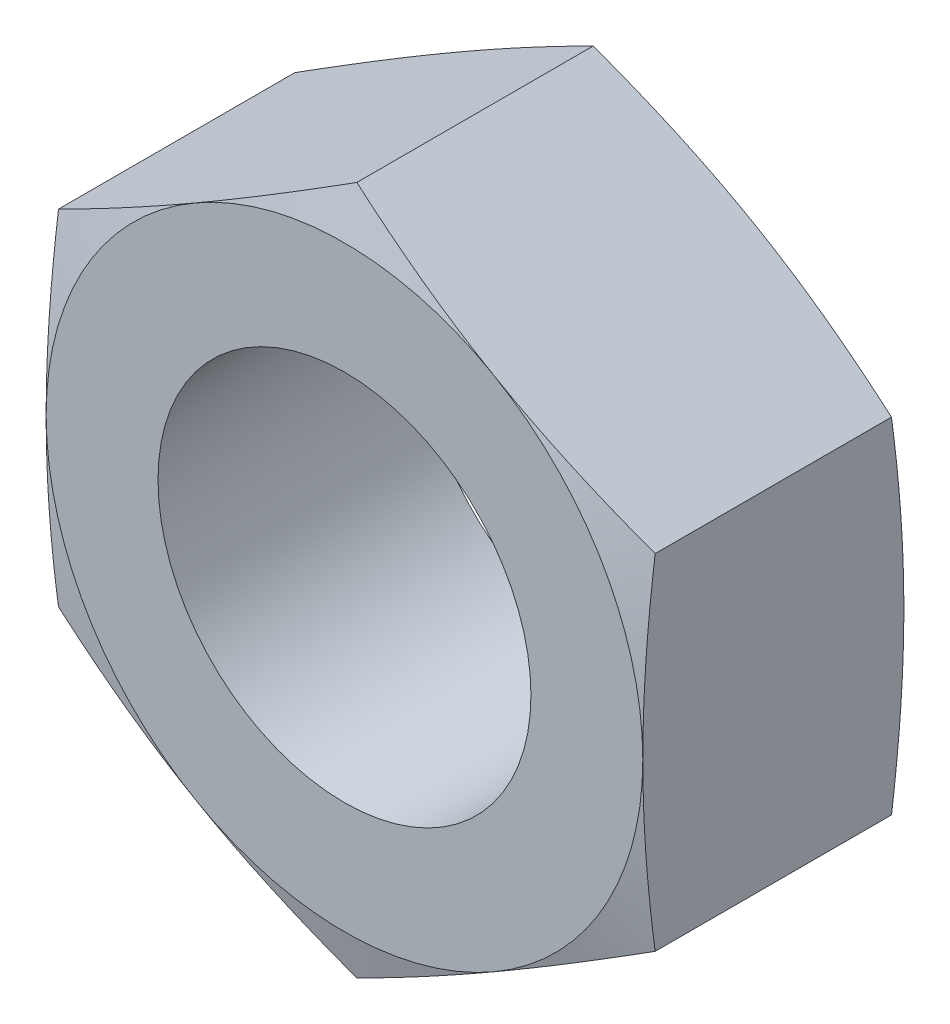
ISO-10303-21;
HEADER;
FILE_DESCRIPTION(('STEP AP214'),'2;1');
FILE_NAME('part.step','',(''),(''),'','','');
FILE_SCHEMA(('AUTOMOTIVE_DESIGN { 1 0 10303 214 1 1 1 1 }'));
ENDSEC;
DATA;
#1=APPLICATION_CONTEXT('core data for automotive mechanical design processes');
#2=APPLICATION_PROTOCOL_DEFINITION('international standard','automotive_design',2000,#1);
#3=PRODUCT_CONTEXT('',#1,'mechanical');
#4=PRODUCT('Part','Part','',(#3));
#5=PRODUCT_RELATED_PRODUCT_CATEGORY('part','',(#4));
#6=PRODUCT_DEFINITION_FORMATION('','',#4);
#7=PRODUCT_DEFINITION_CONTEXT('part definition',#1,'design');
#8=PRODUCT_DEFINITION('design','',#6,#7);
#9=PRODUCT_DEFINITION_SHAPE('','',#8);
#10=(LENGTH_UNIT() NAMED_UNIT(*) SI_UNIT(.MILLI.,.METRE.));
#11=(NAMED_UNIT(*) PLANE_ANGLE_UNIT() SI_UNIT($,.RADIAN.));
#12=(NAMED_UNIT(*) SI_UNIT($,.STERADIAN.) SOLID_ANGLE_UNIT());
#13=UNCERTAINTY_MEASURE_WITH_UNIT(LENGTH_MEASURE(1.E-05),#10,'distance_accuracy_value','');
#14=(GEOMETRIC_REPRESENTATION_CONTEXT(3) GLOBAL_UNCERTAINTY_ASSIGNED_CONTEXT((#13)) GLOBAL_UNIT_ASSIGNED_CONTEXT((#10,
#11,#12)) REPRESENTATION_CONTEXT('',''));
#15=CARTESIAN_POINT('',(0.,0.,0.));
#16=DIRECTION('',(0.,0.,1.));
#17=DIRECTION('',(1.,0.,0.));
#18=AXIS2_PLACEMENT_3D('',#15,#16,#17);
#19=CARTESIAN_POINT('',(0.,0.,7.));
#20=DIRECTION('',(0.,0.,1.));
#21=DIRECTION('',(1.,0.,0.));
#22=AXIS2_PLACEMENT_3D('',#19,#20,#21);
#23=PLANE('',#22);
#24=CARTESIAN_POINT('',(0.,0.,7.));
#25=DIRECTION('',(0.,0.,1.));
#26=DIRECTION('',(1.,0.,0.));
#27=AXIS2_PLACEMENT_3D('',#24,#25,#26);
#28=CIRCLE('',#27,5.);
#29=CARTESIAN_POINT('',(5.,0.,7.));
#30=VERTEX_POINT('',#29);
#31=EDGE_CURVE('E238',#30,#30,#28,.T.);
#32=ORIENTED_EDGE('',*,*,#31,.F.);
#33=EDGE_LOOP('',(#32));
#34=FACE_BOUND('',#33,.T.);
#35=CARTESIAN_POINT('',(0.,0.,7.));
#36=DIRECTION('',(0.,0.,1.));
#37=DIRECTION('',(1.,0.,0.));
#38=AXIS2_PLACEMENT_3D('',#35,#36,#37);
#39=CIRCLE('',#38,8.);
#40=CARTESIAN_POINT('',(4.,-6.92820323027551,7.));
#41=VERTEX_POINT('',#40);
#42=CARTESIAN_POINT('',(8.,0.,7.));
#43=VERTEX_POINT('',#42);
#44=EDGE_CURVE('E150',#41,#43,#39,.T.);
#45=ORIENTED_EDGE('',*,*,#44,.T.);
#46=CARTESIAN_POINT('',(4.,6.92820323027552,7.));
#47=VERTEX_POINT('',#46);
#48=EDGE_CURVE('E152',#43,#47,#39,.T.);
#49=ORIENTED_EDGE('',*,*,#48,.T.);
#50=CARTESIAN_POINT('',(-4.,6.92820323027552,7.));
#51=VERTEX_POINT('',#50);
#52=EDGE_CURVE('E363',#47,#51,#39,.T.);
#53=ORIENTED_EDGE('',*,*,#52,.T.);
#54=CARTESIAN_POINT('',(-8.,0.,7.));
#55=VERTEX_POINT('',#54);
#56=EDGE_CURVE('E36',#51,#55,#39,.T.);
#57=ORIENTED_EDGE('',*,*,#56,.T.);
#58=CARTESIAN_POINT('',(-4.,-6.92820323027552,7.));
#59=VERTEX_POINT('',#58);
#60=EDGE_CURVE('E44',#55,#59,#39,.T.);
#61=ORIENTED_EDGE('',*,*,#60,.T.);
#62=EDGE_CURVE('E365',#59,#41,#39,.T.);
#63=ORIENTED_EDGE('',*,*,#62,.T.);
#64=EDGE_LOOP('',(#45,#49,#53,#57,#61,#63));
#65=FACE_BOUND('',#64,.T.);
#66=ADVANCED_FACE('F14',(#34,#65),#23,.T.);
#67=CARTESIAN_POINT('',(0.,0.,0.));
#68=DIRECTION('',(0.,0.,1.));
#69=DIRECTION('',(1.,0.,0.));
#70=AXIS2_PLACEMENT_3D('',#67,#68,#69);
#71=PLANE('',#70);
#72=CARTESIAN_POINT('',(0.,0.,0.));
#73=DIRECTION('',(0.,0.,1.));
#74=DIRECTION('',(1.,0.,0.));
#75=AXIS2_PLACEMENT_3D('',#72,#73,#74);
#76=CIRCLE('',#75,5.);
#77=CARTESIAN_POINT('',(5.,0.,0.));
#78=VERTEX_POINT('',#77);
#79=EDGE_CURVE('E242',#78,#78,#76,.T.);
#80=ORIENTED_EDGE('',*,*,#79,.T.);
#81=EDGE_LOOP('',(#80));
#82=FACE_BOUND('',#81,.T.);
#83=CARTESIAN_POINT('',(0.,0.,0.));
#84=DIRECTION('',(0.,0.,1.));
#85=DIRECTION('',(1.,0.,0.));
#86=AXIS2_PLACEMENT_3D('',#83,#84,#85);
#87=CIRCLE('',#86,8.);
#88=CARTESIAN_POINT('',(8.,0.,0.));
#89=VERTEX_POINT('',#88);
#90=CARTESIAN_POINT('',(4.,6.92820323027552,0.));
#91=VERTEX_POINT('',#90);
#92=EDGE_CURVE('E122',#89,#91,#87,.T.);
#93=ORIENTED_EDGE('',*,*,#92,.F.);
#94=CARTESIAN_POINT('',(4.,-6.92820323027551,0.));
#95=VERTEX_POINT('',#94);
#96=EDGE_CURVE('E151',#95,#89,#87,.T.);
#97=ORIENTED_EDGE('',*,*,#96,.F.);
#98=CARTESIAN_POINT('',(-4.,-6.92820323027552,0.));
#99=VERTEX_POINT('',#98);
#100=EDGE_CURVE('E147',#99,#95,#87,.T.);
#101=ORIENTED_EDGE('',*,*,#100,.F.);
#102=CARTESIAN_POINT('',(-8.,0.,0.));
#103=VERTEX_POINT('',#102);
#104=EDGE_CURVE('E146',#103,#99,#87,.T.);
#105=ORIENTED_EDGE('',*,*,#104,.F.);
#106=CARTESIAN_POINT('',(-4.,6.92820323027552,0.));
#107=VERTEX_POINT('',#106);
#108=EDGE_CURVE('E123',#107,#103,#87,.T.);
#109=ORIENTED_EDGE('',*,*,#108,.F.);
#110=EDGE_CURVE('E111',#91,#107,#87,.T.);
#111=ORIENTED_EDGE('',*,*,#110,.F.);
#112=EDGE_LOOP('',(#93,#97,#101,#105,#109,#111));
#113=FACE_BOUND('',#112,.T.);
#114=ADVANCED_FACE('F144',(#82,#113),#71,.F.);
#115=CARTESIAN_POINT('',(0.,0.,7.));
#116=DIRECTION('',(0.,0.,-1.));
#117=DIRECTION('',(-1.,0.,0.));
#118=AXIS2_PLACEMENT_3D('',#115,#116,#117);
#119=CYLINDRICAL_SURFACE('',#118,5.);
#120=ORIENTED_EDGE('',*,*,#31,.T.);
#121=EDGE_LOOP('',(#120));
#122=FACE_BOUND('',#121,.T.);
#123=ORIENTED_EDGE('',*,*,#79,.F.);
#124=EDGE_LOOP('',(#123));
#125=FACE_BOUND('',#124,.T.);
#126=ADVANCED_FACE('F182',(#122,#125),#119,.F.);
#127=CARTESIAN_POINT('',(0.,0.,0.892106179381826));
#128=DIRECTION('',(0.,0.,1.));
#129=DIRECTION('',(1.,0.,0.));
#130=AXIS2_PLACEMENT_3D('',#127,#128,#129);
#131=CONICAL_SURFACE('',#130,11.3293855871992,1.30899693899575);
#132=CARTESIAN_POINT('',(8.0002,-4.61868668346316,0.33164601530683));
#133=CARTESIAN_POINT('',(7.66796351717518,-4.81050350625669,0.280227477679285));
#134=CARTESIAN_POINT('',(7.33512465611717,-5.0026681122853,0.233547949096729));
#135=CARTESIAN_POINT('',(6.66827150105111,-5.38767596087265,0.151536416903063));
#136=CARTESIAN_POINT('',(6.33425678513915,-5.58051944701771,0.116209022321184));
#137=CARTESIAN_POINT('',(5.66707702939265,-5.96571585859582,0.0589641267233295));
#138=CARTESIAN_POINT('',(5.33391650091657,-6.15806617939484,0.0369783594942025));
#139=CARTESIAN_POINT('',(4.66717058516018,-6.54301211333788,0.00749769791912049));
#140=CARTESIAN_POINT('',(4.33358529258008,-6.7356076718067,0.));
#141=CARTESIAN_POINT('',(3.6664147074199,-7.12079878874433,0.));
#142=CARTESIAN_POINT('',(3.33282941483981,-7.31339434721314,0.00749769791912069));
#143=CARTESIAN_POINT('',(2.66608349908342,-7.69834028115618,0.0369783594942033));
#144=CARTESIAN_POINT('',(2.33292297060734,-7.8906906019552,0.0589641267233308));
#145=CARTESIAN_POINT('',(1.66574321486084,-8.27588701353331,0.116209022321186));
#146=CARTESIAN_POINT('',(1.33172849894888,-8.46873049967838,0.151536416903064));
#147=CARTESIAN_POINT('',(0.664875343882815,-8.85373834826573,0.23354794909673));
#148=CARTESIAN_POINT('',(0.332036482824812,-9.04590295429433,0.280227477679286));
#149=CARTESIAN_POINT('',(-0.000200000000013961,-9.23771977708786,0.331646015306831));
#150=B_SPLINE_CURVE_WITH_KNOTS('',3,(#132,#133,#134,#135,#136,#137,#138,#139,#140,#141,#142,
#143,#144,#145,#146,#147,#148,#149),.UNSPECIFIED.,.F.,.F.,(4,2,2,2,2,2,2,2,4),(0.,
1.1612532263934,2.322977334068,3.47870589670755,4.63421079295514,5.78971568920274,
6.94544425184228,8.10716835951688,9.26842158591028),.UNSPECIFIED.);
#151=CARTESIAN_POINT('',(8.,-4.618802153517,0.331615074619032));
#152=VERTEX_POINT('',#151);
#153=EDGE_CURVE('E153',#152,#95,#150,.T.);
#154=ORIENTED_EDGE('',*,*,#153,.T.);
#155=ORIENTED_EDGE('',*,*,#96,.T.);
#156=CARTESIAN_POINT('',(8.,-12.2518561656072,1.77715400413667));
#157=CARTESIAN_POINT('',(8.,-11.8885352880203,1.69566254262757));
#158=CARTESIAN_POINT('',(8.,-11.5249880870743,1.61516215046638));
#159=CARTESIAN_POINT('',(8.,-10.7973298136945,1.45667851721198));
#160=CARTESIAN_POINT('',(8.,-10.4332187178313,1.37869538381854));
#161=CARTESIAN_POINT('',(8.,-9.70400001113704,1.2257143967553));
#162=CARTESIAN_POINT('',(8.,-9.33889177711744,1.15071950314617));
#163=CARTESIAN_POINT('',(8.,-8.60791779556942,1.0045191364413));
#164=CARTESIAN_POINT('',(8.,-8.24205205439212,0.933313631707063));
#165=CARTESIAN_POINT('',(8.,-7.51234580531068,0.796143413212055));
#166=CARTESIAN_POINT('',(8.,-7.14851231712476,0.730141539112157));
#167=CARTESIAN_POINT('',(8.,-6.41985477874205,0.603863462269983));
#168=CARTESIAN_POINT('',(8.,-6.05503075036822,0.543587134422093));
#169=CARTESIAN_POINT('',(8.,-5.32431726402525,0.430110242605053));
#170=CARTESIAN_POINT('',(8.,-4.95842793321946,0.376908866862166));
#171=CARTESIAN_POINT('',(8.,-4.22548386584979,0.279143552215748));
#172=CARTESIAN_POINT('',(8.,-3.85842912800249,0.234579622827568));
#173=CARTESIAN_POINT('',(8.,-3.11899889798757,0.155343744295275));
#174=CARTESIAN_POINT('',(8.,-2.74661049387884,0.120790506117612));
#175=CARTESIAN_POINT('',(8.,-2.0008902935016,0.0639552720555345));
#176=CARTESIAN_POINT('',(8.,-1.62755851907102,0.0416729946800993));
#177=CARTESIAN_POINT('',(8.,-0.88049419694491,0.0106788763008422));
#178=CARTESIAN_POINT('',(8.,-0.506761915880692,0.00196073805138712));
#179=CARTESIAN_POINT('',(8.,0.240766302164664,-0.00136832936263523));
#180=CARTESIAN_POINT('',(8.,0.61456223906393,0.00402072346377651));
#181=CARTESIAN_POINT('',(8.,1.36305708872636,0.0286033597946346));
#182=CARTESIAN_POINT('',(8.,1.73775431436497,0.0478472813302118));
#183=CARTESIAN_POINT('',(8.,2.48627200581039,0.0990382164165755));
#184=CARTESIAN_POINT('',(8.,2.86009245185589,0.130985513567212));
#185=CARTESIAN_POINT('',(8.,3.60685276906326,0.205961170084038));
#186=CARTESIAN_POINT('',(7.99999999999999,3.97979189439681,0.248996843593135));
#187=CARTESIAN_POINT('',(8.,4.7244685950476,0.344348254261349));
#188=CARTESIAN_POINT('',(8.,5.09620616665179,0.39666402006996));
#189=CARTESIAN_POINT('',(8.,5.81697867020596,0.505635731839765));
#190=CARTESIAN_POINT('',(8.,6.16607899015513,0.56186352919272));
#191=CARTESIAN_POINT('',(7.99999999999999,6.86335023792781,0.679839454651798));
#192=CARTESIAN_POINT('',(7.99999999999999,7.21152113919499,0.741587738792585));
#193=CARTESIAN_POINT('',(7.99999999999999,7.90706352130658,0.869587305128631));
#194=CARTESIAN_POINT('',(7.99999999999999,8.25443492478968,0.935839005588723));
#195=CARTESIAN_POINT('',(7.99999999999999,8.94846021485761,1.07201009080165));
#196=CARTESIAN_POINT('',(7.99999999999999,9.29511409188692,1.14192952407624));
#197=CARTESIAN_POINT('',(7.99999999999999,9.98788444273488,1.28478356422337));
#198=CARTESIAN_POINT('',(7.99999999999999,10.3340007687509,1.35771888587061));
#199=CARTESIAN_POINT('',(7.99999999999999,11.0257043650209,1.50606013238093));
#200=CARTESIAN_POINT('',(7.99999999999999,11.3712916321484,1.58146607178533));
#201=CARTESIAN_POINT('',(7.99999999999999,12.4073312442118,1.81071761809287));
#202=CARTESIAN_POINT('',(7.99999999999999,13.0971097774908,1.96760706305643));
#203=CARTESIAN_POINT('',(7.99999999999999,14.4685283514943,2.28545064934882));
#204=CARTESIAN_POINT('',(7.99999999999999,15.1501813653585,2.4463491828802));
#205=CARTESIAN_POINT('',(7.99999999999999,16.5125397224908,2.77215878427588));
#206=CARTESIAN_POINT('',(7.99999999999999,17.1932450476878,2.93706992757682));
#207=CARTESIAN_POINT('',(7.99999999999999,18.5530714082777,3.26963758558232));
#208=CARTESIAN_POINT('',(7.99999999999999,19.2321933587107,3.43729036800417));
#209=CARTESIAN_POINT('',(7.99999999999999,20.5898486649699,3.77486747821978));
#210=CARTESIAN_POINT('',(7.99999999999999,21.2683820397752,3.94479172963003));
#211=CARTESIAN_POINT('',(8.,21.946710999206,4.11551906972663));
#212=B_SPLINE_CURVE_WITH_KNOTS('',3,(#156,#157,#158,#159,#160,#161,#162,#163,#164,#165,#166,
#167,#168,#169,#170,#171,#172,#173,#174,#175,#176,#177,#178,#179,#180,#181,#182,#183,#184,#185,
#186,#187,#188,#189,#190,#191,#192,#193,#194,#195,#196,#197,#198,#199,#200,#201,#202,#203,#204,
#205,#206,#207,#208,#209,#210,#211),.UNSPECIFIED.,.F.,.F.,(4,2,2,2,2,2,2,2,2,2,2,2,2,2,2,2,2,2,
2,2,2,2,2,2,2,2,2,4),(0.,1.11704804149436,2.23414381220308,3.35231994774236,4.47048674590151,
5.5797650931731,6.68901919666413,7.79814591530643,8.90727385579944,10.0290611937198,
11.1508227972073,12.2720634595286,13.3933026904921,14.5186363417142,15.6439951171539,
16.7700981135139,17.8962045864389,18.9569505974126,20.0177265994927,21.078601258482,
22.1394899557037,23.2006315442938,24.261779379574,26.3839267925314,28.4850677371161,
30.5862482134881,32.6847736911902,34.7832287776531),.UNSPECIFIED.);
#213=EDGE_CURVE('E186',#89,#152,#212,.F.);
#214=ORIENTED_EDGE('',*,*,#213,.T.);
#215=EDGE_LOOP('',(#154,#155,#214));
#216=FACE_BOUND('',#215,.T.);
#217=ADVANCED_FACE('F179',(#216),#131,.T.);
#218=CARTESIAN_POINT('',(-0.00019999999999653,9.23771977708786,0.331646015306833));
#219=CARTESIAN_POINT('',(0.332036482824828,9.04590295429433,0.280227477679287));
#220=CARTESIAN_POINT('',(0.664875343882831,8.85373834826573,0.233547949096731));
#221=CARTESIAN_POINT('',(1.33172849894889,8.46873049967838,0.151536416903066));
#222=CARTESIAN_POINT('',(1.66574321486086,8.27588701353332,0.116209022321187));
#223=CARTESIAN_POINT('',(2.33292297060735,7.89069060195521,0.0589641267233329));
#224=CARTESIAN_POINT('',(2.66608349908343,7.69834028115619,0.0369783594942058));
#225=CARTESIAN_POINT('',(3.33282941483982,7.31339434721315,0.00749769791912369));
#226=CARTESIAN_POINT('',(3.66641470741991,7.12079878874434,0.));
#227=CARTESIAN_POINT('',(4.33358529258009,6.73560767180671,0.));
#228=CARTESIAN_POINT('',(4.66717058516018,6.54301211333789,0.00749769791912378));
#229=CARTESIAN_POINT('',(5.33391650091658,6.15806617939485,0.0369783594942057));
#230=CARTESIAN_POINT('',(5.66707702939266,5.96571585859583,0.0589641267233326));
#231=CARTESIAN_POINT('',(6.33425678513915,5.58051944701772,0.116209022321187));
#232=CARTESIAN_POINT('',(6.66827150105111,5.38767596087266,0.151536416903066));
#233=CARTESIAN_POINT('',(7.33512465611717,5.00266811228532,0.233547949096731));
#234=CARTESIAN_POINT('',(7.66796351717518,4.81050350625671,0.280227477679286));
#235=CARTESIAN_POINT('',(8.0002,4.61868668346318,0.331646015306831));
#236=B_SPLINE_CURVE_WITH_KNOTS('',3,(#218,#219,#220,#221,#222,#223,#224,#225,#226,#227,#228,
#229,#230,#231,#232,#233,#234,#235),.UNSPECIFIED.,.F.,.F.,(4,2,2,2,2,2,2,2,4),(0.,
1.1612532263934,2.32297733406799,3.47870589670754,4.63421079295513,5.78971568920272,
6.94544425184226,8.10716835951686,9.26842158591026),.UNSPECIFIED.);
#237=CARTESIAN_POINT('',(8.,4.61880215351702,0.331615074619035));
#238=VERTEX_POINT('',#237);
#239=EDGE_CURVE('E162',#91,#238,#236,.T.);
#240=ORIENTED_EDGE('',*,*,#239,.T.);
#241=EDGE_CURVE('E257',#238,#89,#212,.F.);
#242=ORIENTED_EDGE('',*,*,#241,.T.);
#243=ORIENTED_EDGE('',*,*,#92,.T.);
#244=EDGE_LOOP('',(#240,#242,#243));
#245=FACE_BOUND('',#244,.T.);
#246=ADVANCED_FACE('F277',(#245),#131,.T.);
#247=CARTESIAN_POINT('',(0.,0.,7.));
#248=DIRECTION('',(0.,0.,-1.));
#249=DIRECTION('',(-1.,0.,0.));
#250=AXIS2_PLACEMENT_3D('',#247,#248,#249);
#251=CONICAL_SURFACE('',#250,8.,1.30899693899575);
#252=CARTESIAN_POINT('',(8.0002,4.61868668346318,6.66835398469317));
#253=CARTESIAN_POINT('',(7.66796351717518,4.81050350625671,6.71977252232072));
#254=CARTESIAN_POINT('',(7.33512465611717,5.00266811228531,6.76645205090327));
#255=CARTESIAN_POINT('',(6.66827150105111,5.38767596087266,6.84846358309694));
#256=CARTESIAN_POINT('',(6.33425678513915,5.58051944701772,6.88379097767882));
#257=CARTESIAN_POINT('',(5.66707702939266,5.96571585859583,6.94103587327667));
#258=CARTESIAN_POINT('',(5.33391650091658,6.15806617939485,6.9630216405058));
#259=CARTESIAN_POINT('',(4.66717058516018,6.54301211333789,6.99250230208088));
#260=CARTESIAN_POINT('',(4.33358529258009,6.73560767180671,7.));
#261=CARTESIAN_POINT('',(3.66641470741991,7.12079878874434,7.));
#262=CARTESIAN_POINT('',(3.33282941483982,7.31339434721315,6.99250230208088));
#263=CARTESIAN_POINT('',(2.66608349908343,7.69834028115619,6.9630216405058));
#264=CARTESIAN_POINT('',(2.33292297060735,7.89069060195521,6.94103587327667));
#265=CARTESIAN_POINT('',(1.66574321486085,8.27588701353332,6.88379097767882));
#266=CARTESIAN_POINT('',(1.33172849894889,8.46873049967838,6.84846358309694));
#267=CARTESIAN_POINT('',(0.664875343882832,8.85373834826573,6.76645205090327));
#268=CARTESIAN_POINT('',(0.332036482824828,9.04590295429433,6.71977252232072));
#269=CARTESIAN_POINT('',(-0.000199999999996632,9.23771977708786,6.66835398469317));
#270=B_SPLINE_CURVE_WITH_KNOTS('',3,(#252,#253,#254,#255,#256,#257,#258,#259,#260,#261,#262,
#263,#264,#265,#266,#267,#268,#269),.UNSPECIFIED.,.F.,.F.,(4,2,2,2,2,2,2,2,4),(0.,
1.1612532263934,2.32297733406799,3.47870589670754,4.63421079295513,5.78971568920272,
6.94544425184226,8.10716835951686,9.26842158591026),.UNSPECIFIED.);
#271=CARTESIAN_POINT('',(8.,4.61880215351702,6.66838492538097));
#272=VERTEX_POINT('',#271);
#273=EDGE_CURVE('E237',#272,#47,#270,.T.);
#274=ORIENTED_EDGE('',*,*,#273,.T.);
#275=ORIENTED_EDGE('',*,*,#48,.F.);
#276=CARTESIAN_POINT('',(8.,-12.2518561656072,5.22284599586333));
#277=CARTESIAN_POINT('',(8.,-11.8885352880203,5.30433745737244));
#278=CARTESIAN_POINT('',(8.,-11.5249880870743,5.38483784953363));
#279=CARTESIAN_POINT('',(8.,-10.7973298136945,5.54332148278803));
#280=CARTESIAN_POINT('',(8.,-10.4332187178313,5.62130461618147));
#281=CARTESIAN_POINT('',(8.,-9.70400001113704,5.7742856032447));
#282=CARTESIAN_POINT('',(8.,-9.33889177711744,5.84928049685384));
#283=CARTESIAN_POINT('',(8.,-8.60791779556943,5.99548086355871));
#284=CARTESIAN_POINT('',(8.,-8.24205205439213,6.06668636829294));
#285=CARTESIAN_POINT('',(8.,-7.51234580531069,6.20385658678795));
#286=CARTESIAN_POINT('',(8.,-7.14851231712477,6.26985846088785));
#287=CARTESIAN_POINT('',(8.,-6.41985477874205,6.39613653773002));
#288=CARTESIAN_POINT('',(8.,-6.05503075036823,6.45641286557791));
#289=CARTESIAN_POINT('',(8.,-5.32431726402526,6.56988975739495));
#290=CARTESIAN_POINT('',(8.,-4.95842793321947,6.62309113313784));
#291=CARTESIAN_POINT('',(8.,-4.22548386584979,6.72085644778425));
#292=CARTESIAN_POINT('',(8.,-3.8584291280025,6.76542037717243));
#293=CARTESIAN_POINT('',(8.,-3.11899889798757,6.84465625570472));
#294=CARTESIAN_POINT('',(8.,-2.74661049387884,6.87920949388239));
#295=CARTESIAN_POINT('',(8.,-2.0008902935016,6.93604472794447));
#296=CARTESIAN_POINT('',(8.,-1.62755851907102,6.9583270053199));
#297=CARTESIAN_POINT('',(8.,-0.880494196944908,6.98932112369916));
#298=CARTESIAN_POINT('',(8.,-0.50676191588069,6.99803926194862));
#299=CARTESIAN_POINT('',(8.,0.240766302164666,7.00136832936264));
#300=CARTESIAN_POINT('',(8.,0.614562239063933,6.99597927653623));
#301=CARTESIAN_POINT('',(8.,1.36305708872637,6.97139664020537));
#302=CARTESIAN_POINT('',(8.,1.73775431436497,6.95215271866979));
#303=CARTESIAN_POINT('',(8.,2.48627200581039,6.90096178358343));
#304=CARTESIAN_POINT('',(8.,2.86009245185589,6.86901448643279));
#305=CARTESIAN_POINT('',(8.,3.60685276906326,6.79403882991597));
#306=CARTESIAN_POINT('',(7.99999999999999,3.97979189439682,6.75100315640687));
#307=CARTESIAN_POINT('',(8.,4.7244685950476,6.65565174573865));
#308=CARTESIAN_POINT('',(8.,5.09620616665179,6.60333597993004));
#309=CARTESIAN_POINT('',(8.,5.81697867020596,6.49436426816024));
#310=CARTESIAN_POINT('',(8.,6.16607899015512,6.43813647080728));
#311=CARTESIAN_POINT('',(7.99999999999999,6.8633502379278,6.32016054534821));
#312=CARTESIAN_POINT('',(7.99999999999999,7.21152113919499,6.25841226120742));
#313=CARTESIAN_POINT('',(7.99999999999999,7.90706352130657,6.13041269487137));
#314=CARTESIAN_POINT('',(7.99999999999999,8.25443492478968,6.06416099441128));
#315=CARTESIAN_POINT('',(7.99999999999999,8.9484602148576,5.92798990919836));
#316=CARTESIAN_POINT('',(7.99999999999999,9.29511409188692,5.85807047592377));
#317=CARTESIAN_POINT('',(7.99999999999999,9.98788444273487,5.71521643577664));
#318=CARTESIAN_POINT('',(7.99999999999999,10.3340007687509,5.6422811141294));
#319=CARTESIAN_POINT('',(7.99999999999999,11.0257043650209,5.49393986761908));
#320=CARTESIAN_POINT('',(7.99999999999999,11.3712916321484,5.41853392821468));
#321=CARTESIAN_POINT('',(7.99999999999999,12.4073312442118,5.18928238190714));
#322=CARTESIAN_POINT('',(7.99999999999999,13.0971097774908,5.03239293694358));
#323=CARTESIAN_POINT('',(7.99999999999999,14.4685283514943,4.71454935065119));
#324=CARTESIAN_POINT('',(7.99999999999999,15.1501813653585,4.55365081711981));
#325=CARTESIAN_POINT('',(7.99999999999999,16.5125397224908,4.22784121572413));
#326=CARTESIAN_POINT('',(7.99999999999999,17.1932450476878,4.06293007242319));
#327=CARTESIAN_POINT('',(7.99999999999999,18.5530714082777,3.73036241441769));
#328=CARTESIAN_POINT('',(7.99999999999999,19.2321933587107,3.56270963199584));
#329=CARTESIAN_POINT('',(7.99999999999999,20.5898486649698,3.22513252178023));
#330=CARTESIAN_POINT('',(7.99999999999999,21.2683820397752,3.05520827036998));
#331=CARTESIAN_POINT('',(8.,21.946710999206,2.88448093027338));
#332=B_SPLINE_CURVE_WITH_KNOTS('',3,(#276,#277,#278,#279,#280,#281,#282,#283,#284,#285,#286,
#287,#288,#289,#290,#291,#292,#293,#294,#295,#296,#297,#298,#299,#300,#301,#302,#303,#304,#305,
#306,#307,#308,#309,#310,#311,#312,#313,#314,#315,#316,#317,#318,#319,#320,#321,#322,#323,#324,
#325,#326,#327,#328,#329,#330,#331),.UNSPECIFIED.,.F.,.F.,(4,2,2,2,2,2,2,2,2,2,2,2,2,2,2,2,2,2,
2,2,2,2,2,2,2,2,2,4),(0.,1.11704804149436,2.23414381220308,3.35231994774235,4.47048674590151,
5.57976509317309,6.68901919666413,7.79814591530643,8.90727385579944,10.0290611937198,
11.1508227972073,12.2720634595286,13.3933026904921,14.5186363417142,15.6439951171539,
16.7700981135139,17.8962045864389,18.9569505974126,20.0177265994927,21.078601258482,
22.1394899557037,23.2006315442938,24.261779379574,26.3839267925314,28.4850677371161,
30.5862482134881,32.6847736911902,34.7832287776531),.UNSPECIFIED.);
#333=EDGE_CURVE('E19',#43,#272,#332,.T.);
#334=ORIENTED_EDGE('',*,*,#333,.T.);
#335=EDGE_LOOP('',(#274,#275,#334));
#336=FACE_BOUND('',#335,.T.);
#337=ADVANCED_FACE('F180',(#336),#251,.T.);
#338=CARTESIAN_POINT('',(-0.000200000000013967,-9.23771977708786,6.66835398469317));
#339=CARTESIAN_POINT('',(0.332036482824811,-9.04590295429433,6.71977252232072));
#340=CARTESIAN_POINT('',(0.664875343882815,-8.85373834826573,6.76645205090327));
#341=CARTESIAN_POINT('',(1.33172849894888,-8.46873049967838,6.84846358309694));
#342=CARTESIAN_POINT('',(1.66574321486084,-8.27588701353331,6.88379097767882));
#343=CARTESIAN_POINT('',(2.33292297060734,-7.8906906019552,6.94103587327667));
#344=CARTESIAN_POINT('',(2.66608349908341,-7.69834028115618,6.9630216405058));
#345=CARTESIAN_POINT('',(3.33282941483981,-7.31339434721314,6.99250230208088));
#346=CARTESIAN_POINT('',(3.6664147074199,-7.12079878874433,7.));
#347=CARTESIAN_POINT('',(4.33358529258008,-6.7356076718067,7.));
#348=CARTESIAN_POINT('',(4.66717058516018,-6.54301211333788,6.99250230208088));
#349=CARTESIAN_POINT('',(5.33391650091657,-6.15806617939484,6.9630216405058));
#350=CARTESIAN_POINT('',(5.66707702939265,-5.96571585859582,6.94103587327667));
#351=CARTESIAN_POINT('',(6.33425678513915,-5.58051944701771,6.88379097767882));
#352=CARTESIAN_POINT('',(6.66827150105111,-5.38767596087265,6.84846358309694));
#353=CARTESIAN_POINT('',(7.33512465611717,-5.0026681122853,6.76645205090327));
#354=CARTESIAN_POINT('',(7.66796351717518,-4.81050350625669,6.71977252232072));
#355=CARTESIAN_POINT('',(8.0002,-4.61868668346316,6.66835398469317));
#356=B_SPLINE_CURVE_WITH_KNOTS('',3,(#338,#339,#340,#341,#342,#343,#344,#345,#346,#347,#348,
#349,#350,#351,#352,#353,#354,#355),.UNSPECIFIED.,.F.,.F.,(4,2,2,2,2,2,2,2,4),(0.,
1.16125322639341,2.322977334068,3.47870589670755,4.63421079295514,5.78971568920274,
6.94544425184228,8.10716835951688,9.26842158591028),.UNSPECIFIED.);
#357=CARTESIAN_POINT('',(8.,-4.618802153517,6.66838492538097));
#358=VERTEX_POINT('',#357);
#359=EDGE_CURVE('E285',#41,#358,#356,.T.);
#360=ORIENTED_EDGE('',*,*,#359,.T.);
#361=EDGE_CURVE('E9',#358,#43,#332,.T.);
#362=ORIENTED_EDGE('',*,*,#361,.T.);
#363=ORIENTED_EDGE('',*,*,#44,.F.);
#364=EDGE_LOOP('',(#360,#362,#363));
#365=FACE_BOUND('',#364,.T.);
#366=ADVANCED_FACE('F337',(#365),#251,.T.);
#367=CARTESIAN_POINT('',(0.000199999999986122,-9.23771977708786,0.331646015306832));
#368=CARTESIAN_POINT('',(-0.332036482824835,-9.04590295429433,0.280227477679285));
#369=CARTESIAN_POINT('',(-0.664875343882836,-8.85373834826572,0.233547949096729));
#370=CARTESIAN_POINT('',(-1.3317284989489,-8.46873049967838,0.151536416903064));
#371=CARTESIAN_POINT('',(-1.66574321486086,-8.27588701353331,0.116209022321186));
#372=CARTESIAN_POINT('',(-2.33292297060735,-7.8906906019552,0.0589641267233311));
#373=CARTESIAN_POINT('',(-2.66608349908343,-7.69834028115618,0.0369783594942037));
#374=CARTESIAN_POINT('',(-3.33282941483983,-7.31339434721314,0.00749769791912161));
#375=CARTESIAN_POINT('',(-3.66641470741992,-7.12079878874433,0.));
#376=CARTESIAN_POINT('',(-4.33358529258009,-6.7356076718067,0.));
#377=CARTESIAN_POINT('',(-4.66717058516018,-6.54301211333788,0.00749769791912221));
#378=CARTESIAN_POINT('',(-5.33391650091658,-6.15806617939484,0.0369783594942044));
#379=CARTESIAN_POINT('',(-5.66707702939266,-5.96571585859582,0.0589641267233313));
#380=CARTESIAN_POINT('',(-6.33425678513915,-5.58051944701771,0.116209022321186));
#381=CARTESIAN_POINT('',(-6.66827150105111,-5.38767596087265,0.151536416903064));
#382=CARTESIAN_POINT('',(-7.33512465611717,-5.0026681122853,0.23354794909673));
#383=CARTESIAN_POINT('',(-7.66796351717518,-4.8105035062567,0.280227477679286));
#384=CARTESIAN_POINT('',(-8.0002,-4.61868668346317,0.331646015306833));
#385=B_SPLINE_CURVE_WITH_KNOTS('',3,(#367,#368,#369,#370,#371,#372,#373,#374,#375,#376,#377,
#378,#379,#380,#381,#382,#383,#384),.UNSPECIFIED.,.F.,.F.,(4,2,2,2,2,2,2,2,4),(0.,
1.1612532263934,2.32297733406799,3.47870589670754,4.63421079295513,5.78971568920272,
6.94544425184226,8.10716835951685,9.26842158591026),.UNSPECIFIED.);
#386=CARTESIAN_POINT('',(0.,-9.23760430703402,0.331615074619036));
#387=VERTEX_POINT('',#386);
#388=EDGE_CURVE('E142',#387,#99,#385,.T.);
#389=ORIENTED_EDGE('',*,*,#388,.T.);
#390=ORIENTED_EDGE('',*,*,#100,.T.);
#391=EDGE_CURVE('E163',#95,#387,#150,.T.);
#392=ORIENTED_EDGE('',*,*,#391,.T.);
#393=EDGE_LOOP('',(#389,#390,#392));
#394=FACE_BOUND('',#393,.T.);
#395=ADVANCED_FACE('F334',(#394),#131,.T.);
#396=CARTESIAN_POINT('',(-8.0002,-4.61868668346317,6.66835398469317));
#397=CARTESIAN_POINT('',(-7.66796351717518,-4.8105035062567,6.71977252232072));
#398=CARTESIAN_POINT('',(-7.33512465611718,-5.0026681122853,6.76645205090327));
#399=CARTESIAN_POINT('',(-6.66827150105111,-5.38767596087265,6.84846358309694));
#400=CARTESIAN_POINT('',(-6.33425678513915,-5.58051944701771,6.88379097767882));
#401=CARTESIAN_POINT('',(-5.66707702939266,-5.96571585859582,6.94103587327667));
#402=CARTESIAN_POINT('',(-5.33391650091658,-6.15806617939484,6.9630216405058));
#403=CARTESIAN_POINT('',(-4.66717058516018,-6.54301211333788,6.99250230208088));
#404=CARTESIAN_POINT('',(-4.33358529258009,-6.7356076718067,7.));
#405=CARTESIAN_POINT('',(-3.66641470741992,-7.12079878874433,7.));
#406=CARTESIAN_POINT('',(-3.33282941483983,-7.31339434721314,6.99250230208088));
#407=CARTESIAN_POINT('',(-2.66608349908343,-7.69834028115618,6.9630216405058));
#408=CARTESIAN_POINT('',(-2.33292297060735,-7.8906906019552,6.94103587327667));
#409=CARTESIAN_POINT('',(-1.66574321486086,-8.27588701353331,6.88379097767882));
#410=CARTESIAN_POINT('',(-1.3317284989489,-8.46873049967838,6.84846358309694));
#411=CARTESIAN_POINT('',(-0.664875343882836,-8.85373834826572,6.76645205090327));
#412=CARTESIAN_POINT('',(-0.332036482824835,-9.04590295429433,6.71977252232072));
#413=CARTESIAN_POINT('',(0.000199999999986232,-9.23771977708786,6.66835398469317));
#414=B_SPLINE_CURVE_WITH_KNOTS('',3,(#396,#397,#398,#399,#400,#401,#402,#403,#404,#405,#406,
#407,#408,#409,#410,#411,#412,#413),.UNSPECIFIED.,.F.,.F.,(4,2,2,2,2,2,2,2,4),(0.,
1.1612532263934,2.32297733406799,3.47870589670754,4.63421079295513,5.78971568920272,
6.94544425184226,8.10716835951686,9.26842158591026),.UNSPECIFIED.);
#415=CARTESIAN_POINT('',(0.,-9.23760430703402,6.66838492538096));
#416=VERTEX_POINT('',#415);
#417=EDGE_CURVE('E290',#59,#416,#414,.T.);
#418=ORIENTED_EDGE('',*,*,#417,.T.);
#419=EDGE_CURVE('E286',#416,#41,#356,.T.);
#420=ORIENTED_EDGE('',*,*,#419,.T.);
#421=ORIENTED_EDGE('',*,*,#62,.F.);
#422=EDGE_LOOP('',(#418,#420,#421));
#423=FACE_BOUND('',#422,.T.);
#424=ADVANCED_FACE('F177',(#423),#251,.T.);
#425=CARTESIAN_POINT('',(-8.,-12.2518561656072,1.77715400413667));
#426=CARTESIAN_POINT('',(-8.,-11.8885352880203,1.69566254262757));
#427=CARTESIAN_POINT('',(-8.,-11.5249880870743,1.61516215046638));
#428=CARTESIAN_POINT('',(-8.,-10.7973298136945,1.45667851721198));
#429=CARTESIAN_POINT('',(-8.,-10.4332187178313,1.37869538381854));
#430=CARTESIAN_POINT('',(-8.,-9.70400001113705,1.2257143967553));
#431=CARTESIAN_POINT('',(-8.,-9.33889177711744,1.15071950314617));
#432=CARTESIAN_POINT('',(-8.,-8.60791779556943,1.0045191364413));
#433=CARTESIAN_POINT('',(-8.,-8.24205205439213,0.933313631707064));
#434=CARTESIAN_POINT('',(-8.,-7.51234580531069,0.796143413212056));
#435=CARTESIAN_POINT('',(-8.,-7.14851231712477,0.730141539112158));
#436=CARTESIAN_POINT('',(-8.,-6.41985477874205,0.603863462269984));
#437=CARTESIAN_POINT('',(-8.,-6.05503075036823,0.543587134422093));
#438=CARTESIAN_POINT('',(-8.,-5.32431726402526,0.430110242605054));
#439=CARTESIAN_POINT('',(-8.,-4.95842793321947,0.376908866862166));
#440=CARTESIAN_POINT('',(-8.,-4.22548386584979,0.27914355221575));
#441=CARTESIAN_POINT('',(-8.,-3.8584291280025,0.234579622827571));
#442=CARTESIAN_POINT('',(-8.,-3.11899889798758,0.155343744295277));
#443=CARTESIAN_POINT('',(-8.,-2.74661049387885,0.120790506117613));
#444=CARTESIAN_POINT('',(-8.,-2.00089029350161,0.0639552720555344));
#445=CARTESIAN_POINT('',(-8.,-1.62755851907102,0.0416729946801));
#446=CARTESIAN_POINT('',(-8.,-0.880494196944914,0.0106788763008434));
#447=CARTESIAN_POINT('',(-8.,-0.506761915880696,0.00196073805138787));
#448=CARTESIAN_POINT('',(-8.,0.24076630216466,-0.00136832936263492));
#449=CARTESIAN_POINT('',(-8.,0.614562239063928,0.00402072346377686));
#450=CARTESIAN_POINT('',(-8.,1.36305708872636,0.0286033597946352));
#451=CARTESIAN_POINT('',(-8.,1.73775431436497,0.0478472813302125));
#452=CARTESIAN_POINT('',(-8.,2.48627200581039,0.0990382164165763));
#453=CARTESIAN_POINT('',(-8.,2.86009245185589,0.130985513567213));
#454=CARTESIAN_POINT('',(-8.,3.60685276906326,0.205961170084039));
#455=CARTESIAN_POINT('',(-8.,3.97979189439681,0.248996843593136));
#456=CARTESIAN_POINT('',(-8.,4.7244685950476,0.34434825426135));
#457=CARTESIAN_POINT('',(-8.,5.09620616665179,0.396664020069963));
#458=CARTESIAN_POINT('',(-8.,5.81697867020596,0.505635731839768));
#459=CARTESIAN_POINT('',(-8.,6.16607899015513,0.561863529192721));
#460=CARTESIAN_POINT('',(-8.,6.86335023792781,0.679839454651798));
#461=CARTESIAN_POINT('',(-8.,7.21152113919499,0.741587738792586));
#462=CARTESIAN_POINT('',(-8.,7.90706352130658,0.869587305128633));
#463=CARTESIAN_POINT('',(-8.,8.25443492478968,0.935839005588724));
#464=CARTESIAN_POINT('',(-8.,8.94846021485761,1.07201009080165));
#465=CARTESIAN_POINT('',(-8.,9.29511409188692,1.14192952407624));
#466=CARTESIAN_POINT('',(-8.,9.98788444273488,1.28478356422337));
#467=CARTESIAN_POINT('',(-8.,10.3340007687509,1.35771888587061));
#468=CARTESIAN_POINT('',(-8.,11.0257043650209,1.50606013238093));
#469=CARTESIAN_POINT('',(-8.,11.3712916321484,1.58146607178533));
#470=CARTESIAN_POINT('',(-8.,12.4073312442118,1.81071761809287));
#471=CARTESIAN_POINT('',(-8.,13.0971097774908,1.96760706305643));
#472=CARTESIAN_POINT('',(-8.,14.4685283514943,2.28545064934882));
#473=CARTESIAN_POINT('',(-8.,15.1501813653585,2.4463491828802));
#474=CARTESIAN_POINT('',(-8.,16.5125397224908,2.77215878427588));
#475=CARTESIAN_POINT('',(-8.,17.1932450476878,2.93706992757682));
#476=CARTESIAN_POINT('',(-8.,18.5530714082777,3.26963758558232));
#477=CARTESIAN_POINT('',(-8.,19.2321933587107,3.43729036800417));
#478=CARTESIAN_POINT('',(-8.,20.5898486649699,3.77486747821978));
#479=CARTESIAN_POINT('',(-8.,21.2683820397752,3.94479172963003));
#480=CARTESIAN_POINT('',(-8.,21.946710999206,4.11551906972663));
#481=B_SPLINE_CURVE_WITH_KNOTS('',3,(#425,#426,#427,#428,#429,#430,#431,#432,#433,#434,#435,
#436,#437,#438,#439,#440,#441,#442,#443,#444,#445,#446,#447,#448,#449,#450,#451,#452,#453,#454,
#455,#456,#457,#458,#459,#460,#461,#462,#463,#464,#465,#466,#467,#468,#469,#470,#471,#472,#473,
#474,#475,#476,#477,#478,#479,#480),.UNSPECIFIED.,.F.,.F.,(4,2,2,2,2,2,2,2,2,2,2,2,2,2,2,2,2,2,
2,2,2,2,2,2,2,2,2,4),(0.,1.11704804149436,2.23414381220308,3.35231994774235,4.4704867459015,
5.57976509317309,6.68901919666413,7.79814591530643,8.90727385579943,10.0290611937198,
11.1508227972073,12.2720634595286,13.3933026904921,14.5186363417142,15.6439951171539,
16.7700981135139,17.8962045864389,18.9569505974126,20.0177265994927,21.078601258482,
22.1394899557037,23.2006315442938,24.261779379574,26.3839267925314,28.4850677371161,
30.5862482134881,32.6847736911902,34.7832287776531),.UNSPECIFIED.);
#482=CARTESIAN_POINT('',(-8.,-4.61880215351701,0.331615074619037));
#483=VERTEX_POINT('',#482);
#484=EDGE_CURVE('E284',#483,#103,#481,.T.);
#485=ORIENTED_EDGE('',*,*,#484,.T.);
#486=ORIENTED_EDGE('',*,*,#104,.T.);
#487=EDGE_CURVE('E135',#99,#483,#385,.T.);
#488=ORIENTED_EDGE('',*,*,#487,.T.);
#489=EDGE_LOOP('',(#485,#486,#488));
#490=FACE_BOUND('',#489,.T.);
#491=ADVANCED_FACE('F172',(#490),#131,.T.);
#492=CARTESIAN_POINT('',(-8.,-12.2518561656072,5.22284599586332));
#493=CARTESIAN_POINT('',(-8.,-11.8885352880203,5.30433745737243));
#494=CARTESIAN_POINT('',(-8.,-11.5249880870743,5.38483784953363));
#495=CARTESIAN_POINT('',(-8.,-10.7973298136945,5.54332148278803));
#496=CARTESIAN_POINT('',(-8.,-10.4332187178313,5.62130461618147));
#497=CARTESIAN_POINT('',(-8.,-9.70400001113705,5.7742856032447));
#498=CARTESIAN_POINT('',(-8.,-9.33889177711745,5.84928049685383));
#499=CARTESIAN_POINT('',(-8.,-8.60791779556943,5.9954808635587));
#500=CARTESIAN_POINT('',(-8.,-8.24205205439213,6.06668636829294));
#501=CARTESIAN_POINT('',(-8.,-7.51234580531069,6.20385658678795));
#502=CARTESIAN_POINT('',(-8.,-7.14851231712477,6.26985846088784));
#503=CARTESIAN_POINT('',(-8.,-6.41985477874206,6.39613653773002));
#504=CARTESIAN_POINT('',(-8.,-6.05503075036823,6.45641286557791));
#505=CARTESIAN_POINT('',(-8.,-5.32431726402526,6.56988975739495));
#506=CARTESIAN_POINT('',(-8.,-4.95842793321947,6.62309113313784));
#507=CARTESIAN_POINT('',(-8.,-4.2254838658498,6.72085644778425));
#508=CARTESIAN_POINT('',(-8.,-3.85842912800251,6.76542037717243));
#509=CARTESIAN_POINT('',(-8.,-3.11899889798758,6.84465625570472));
#510=CARTESIAN_POINT('',(-8.,-2.74661049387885,6.87920949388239));
#511=CARTESIAN_POINT('',(-8.,-2.00089029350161,6.93604472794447));
#512=CARTESIAN_POINT('',(-8.,-1.62755851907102,6.9583270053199));
#513=CARTESIAN_POINT('',(-8.,-0.880494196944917,6.98932112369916));
#514=CARTESIAN_POINT('',(-8.,-0.506761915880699,6.99803926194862));
#515=CARTESIAN_POINT('',(-8.,0.240766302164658,7.00136832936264));
#516=CARTESIAN_POINT('',(-8.,0.614562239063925,6.99597927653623));
#517=CARTESIAN_POINT('',(-8.,1.36305708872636,6.97139664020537));
#518=CARTESIAN_POINT('',(-8.,1.73775431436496,6.95215271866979));
#519=CARTESIAN_POINT('',(-8.,2.48627200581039,6.90096178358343));
#520=CARTESIAN_POINT('',(-8.,2.86009245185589,6.86901448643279));
#521=CARTESIAN_POINT('',(-8.,3.60685276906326,6.79403882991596));
#522=CARTESIAN_POINT('',(-8.,3.97979189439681,6.75100315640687));
#523=CARTESIAN_POINT('',(-8.,4.7244685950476,6.65565174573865));
#524=CARTESIAN_POINT('',(-8.,5.09620616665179,6.60333597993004));
#525=CARTESIAN_POINT('',(-8.,5.81697867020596,6.49436426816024));
#526=CARTESIAN_POINT('',(-8.,6.16607899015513,6.43813647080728));
#527=CARTESIAN_POINT('',(-8.,6.8633502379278,6.32016054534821));
#528=CARTESIAN_POINT('',(-8.,7.21152113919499,6.25841226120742));
#529=CARTESIAN_POINT('',(-8.,7.90706352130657,6.13041269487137));
#530=CARTESIAN_POINT('',(-8.,8.25443492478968,6.06416099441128));
#531=CARTESIAN_POINT('',(-8.,8.94846021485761,5.92798990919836));
#532=CARTESIAN_POINT('',(-8.,9.29511409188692,5.85807047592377));
#533=CARTESIAN_POINT('',(-8.,9.98788444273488,5.71521643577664));
#534=CARTESIAN_POINT('',(-8.,10.3340007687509,5.64228111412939));
#535=CARTESIAN_POINT('',(-8.,11.0257043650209,5.49393986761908));
#536=CARTESIAN_POINT('',(-8.,11.3712916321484,5.41853392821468));
#537=CARTESIAN_POINT('',(-8.,12.4073312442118,5.18928238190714));
#538=CARTESIAN_POINT('',(-8.,13.0971097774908,5.03239293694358));
#539=CARTESIAN_POINT('',(-8.,14.4685283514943,4.71454935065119));
#540=CARTESIAN_POINT('',(-8.,15.1501813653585,4.55365081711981));
#541=CARTESIAN_POINT('',(-8.,16.5125397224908,4.22784121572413));
#542=CARTESIAN_POINT('',(-8.,17.1932450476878,4.06293007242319));
#543=CARTESIAN_POINT('',(-8.,18.5530714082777,3.73036241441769));
#544=CARTESIAN_POINT('',(-8.,19.2321933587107,3.56270963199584));
#545=CARTESIAN_POINT('',(-8.,20.5898486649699,3.22513252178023));
#546=CARTESIAN_POINT('',(-8.,21.2683820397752,3.05520827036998));
#547=CARTESIAN_POINT('',(-8.,21.946710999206,2.88448093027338));
#548=B_SPLINE_CURVE_WITH_KNOTS('',3,(#492,#493,#494,#495,#496,#497,#498,#499,#500,#501,#502,
#503,#504,#505,#506,#507,#508,#509,#510,#511,#512,#513,#514,#515,#516,#517,#518,#519,#520,#521,
#522,#523,#524,#525,#526,#527,#528,#529,#530,#531,#532,#533,#534,#535,#536,#537,#538,#539,#540,
#541,#542,#543,#544,#545,#546,#547),.UNSPECIFIED.,.F.,.F.,(4,2,2,2,2,2,2,2,2,2,2,2,2,2,2,2,2,2,
2,2,2,2,2,2,2,2,2,4),(0.,1.11704804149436,2.23414381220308,3.35231994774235,4.4704867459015,
5.57976509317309,6.68901919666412,7.79814591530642,8.90727385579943,10.0290611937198,
11.1508227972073,12.2720634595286,13.3933026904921,14.5186363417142,15.6439951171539,
16.7700981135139,17.8962045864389,18.9569505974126,20.0177265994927,21.078601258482,
22.1394899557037,23.2006315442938,24.261779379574,26.3839267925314,28.4850677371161,
30.5862482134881,32.6847736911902,34.7832287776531),.UNSPECIFIED.);
#549=CARTESIAN_POINT('',(-8.,-4.61880215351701,6.66838492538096));
#550=VERTEX_POINT('',#549);
#551=EDGE_CURVE('E225',#55,#550,#548,.F.);
#552=ORIENTED_EDGE('',*,*,#551,.T.);
#553=EDGE_CURVE('E299',#550,#59,#414,.T.);
#554=ORIENTED_EDGE('',*,*,#553,.T.);
#555=ORIENTED_EDGE('',*,*,#60,.F.);
#556=EDGE_LOOP('',(#552,#554,#555));
#557=FACE_BOUND('',#556,.T.);
#558=ADVANCED_FACE('F176',(#557),#251,.T.);
#559=CARTESIAN_POINT('',(-8.,4.61880215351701,0.331615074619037));
#560=VERTEX_POINT('',#559);
#561=EDGE_CURVE('E131',#103,#560,#481,.T.);
#562=ORIENTED_EDGE('',*,*,#561,.T.);
#563=CARTESIAN_POINT('',(-8.0002,4.61868668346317,0.331646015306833));
#564=CARTESIAN_POINT('',(-7.66796351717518,4.8105035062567,0.280227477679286));
#565=CARTESIAN_POINT('',(-7.33512465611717,5.00266811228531,0.23354794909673));
#566=CARTESIAN_POINT('',(-6.66827150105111,5.38767596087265,0.151536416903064));
#567=CARTESIAN_POINT('',(-6.33425678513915,5.58051944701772,0.116209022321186));
#568=CARTESIAN_POINT('',(-5.66707702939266,5.96571585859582,0.0589641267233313));
#569=CARTESIAN_POINT('',(-5.33391650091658,6.15806617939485,0.0369783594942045));
#570=CARTESIAN_POINT('',(-4.66717058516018,6.54301211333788,0.00749769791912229));
#571=CARTESIAN_POINT('',(-4.33358529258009,6.7356076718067,0.));
#572=CARTESIAN_POINT('',(-3.66641470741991,7.12079878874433,0.));
#573=CARTESIAN_POINT('',(-3.33282941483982,7.31339434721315,0.00749769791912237));
#574=CARTESIAN_POINT('',(-2.66608349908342,7.69834028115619,0.0369783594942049));
#575=CARTESIAN_POINT('',(-2.33292297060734,7.89069060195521,0.058964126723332));
#576=CARTESIAN_POINT('',(-1.66574321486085,8.27588701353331,0.116209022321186));
#577=CARTESIAN_POINT('',(-1.33172849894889,8.46873049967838,0.151536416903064));
#578=CARTESIAN_POINT('',(-0.664875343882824,8.85373834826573,0.23354794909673));
#579=CARTESIAN_POINT('',(-0.33203648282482,9.04590295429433,0.280227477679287));
#580=CARTESIAN_POINT('',(0.000200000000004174,9.23771977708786,0.331646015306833));
#581=B_SPLINE_CURVE_WITH_KNOTS('',3,(#563,#564,#565,#566,#567,#568,#569,#570,#571,#572,#573,
#574,#575,#576,#577,#578,#579,#580),.UNSPECIFIED.,.F.,.F.,(4,2,2,2,2,2,2,2,4),(0.,
1.1612532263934,2.322977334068,3.47870589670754,4.63421079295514,5.78971568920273,
6.94544425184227,8.10716835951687,9.26842158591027),.UNSPECIFIED.);
#582=EDGE_CURVE('E127',#560,#107,#581,.T.);
#583=ORIENTED_EDGE('',*,*,#582,.T.);
#584=ORIENTED_EDGE('',*,*,#108,.T.);
#585=EDGE_LOOP('',(#562,#583,#584));
#586=FACE_BOUND('',#585,.T.);
#587=ADVANCED_FACE('F128',(#586),#131,.T.);
#588=CARTESIAN_POINT('',(0.000200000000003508,9.23771977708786,6.66835398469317));
#589=CARTESIAN_POINT('',(-0.332036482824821,9.04590295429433,6.71977252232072));
#590=CARTESIAN_POINT('',(-0.664875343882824,8.85373834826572,6.76645205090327));
#591=CARTESIAN_POINT('',(-1.33172849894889,8.46873049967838,6.84846358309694));
#592=CARTESIAN_POINT('',(-1.66574321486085,8.27588701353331,6.88379097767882));
#593=CARTESIAN_POINT('',(-2.33292297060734,7.89069060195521,6.94103587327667));
#594=CARTESIAN_POINT('',(-2.66608349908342,7.69834028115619,6.9630216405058));
#595=CARTESIAN_POINT('',(-3.33282941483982,7.31339434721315,6.99250230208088));
#596=CARTESIAN_POINT('',(-3.66641470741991,7.12079878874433,7.));
#597=CARTESIAN_POINT('',(-4.33358529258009,6.7356076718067,7.));
#598=CARTESIAN_POINT('',(-4.66717058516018,6.54301211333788,6.99250230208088));
#599=CARTESIAN_POINT('',(-5.33391650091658,6.15806617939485,6.9630216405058));
#600=CARTESIAN_POINT('',(-5.66707702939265,5.96571585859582,6.94103587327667));
#601=CARTESIAN_POINT('',(-6.33425678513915,5.58051944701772,6.88379097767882));
#602=CARTESIAN_POINT('',(-6.66827150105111,5.38767596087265,6.84846358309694));
#603=CARTESIAN_POINT('',(-7.33512465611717,5.00266811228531,6.76645205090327));
#604=CARTESIAN_POINT('',(-7.66796351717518,4.8105035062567,6.71977252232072));
#605=CARTESIAN_POINT('',(-8.0002,4.61868668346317,6.66835398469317));
#606=B_SPLINE_CURVE_WITH_KNOTS('',3,(#588,#589,#590,#591,#592,#593,#594,#595,#596,#597,#598,
#599,#600,#601,#602,#603,#604,#605),.UNSPECIFIED.,.F.,.F.,(4,2,2,2,2,2,2,2,4),(0.,
1.1612532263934,2.322977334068,3.47870589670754,4.63421079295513,5.78971568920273,
6.94544425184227,8.10716835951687,9.26842158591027),.UNSPECIFIED.);
#607=CARTESIAN_POINT('',(-8.,4.61880215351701,6.66838492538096));
#608=VERTEX_POINT('',#607);
#609=EDGE_CURVE('E216',#51,#608,#606,.T.);
#610=ORIENTED_EDGE('',*,*,#609,.T.);
#611=EDGE_CURVE('E224',#608,#55,#548,.F.);
#612=ORIENTED_EDGE('',*,*,#611,.T.);
#613=ORIENTED_EDGE('',*,*,#56,.F.);
#614=EDGE_LOOP('',(#610,#612,#613));
#615=FACE_BOUND('',#614,.T.);
#616=ADVANCED_FACE('F330',(#615),#251,.T.);
#617=CARTESIAN_POINT('',(0.,9.23760430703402,0.331615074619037));
#618=VERTEX_POINT('',#617);
#619=EDGE_CURVE('E115',#107,#618,#581,.T.);
#620=ORIENTED_EDGE('',*,*,#619,.T.);
#621=EDGE_CURVE('E117',#618,#91,#236,.T.);
#622=ORIENTED_EDGE('',*,*,#621,.T.);
#623=ORIENTED_EDGE('',*,*,#110,.T.);
#624=EDGE_LOOP('',(#620,#622,#623));
#625=FACE_BOUND('',#624,.T.);
#626=ADVANCED_FACE('F113',(#625),#131,.T.);
#627=CARTESIAN_POINT('',(0.,9.23760430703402,6.66838492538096));
#628=VERTEX_POINT('',#627);
#629=EDGE_CURVE('E231',#47,#628,#270,.T.);
#630=ORIENTED_EDGE('',*,*,#629,.T.);
#631=EDGE_CURVE('E223',#628,#51,#606,.T.);
#632=ORIENTED_EDGE('',*,*,#631,.T.);
#633=ORIENTED_EDGE('',*,*,#52,.F.);
#634=EDGE_LOOP('',(#630,#632,#633));
#635=FACE_BOUND('',#634,.T.);
#636=ADVANCED_FACE('F324',(#635),#251,.T.);
#637=CARTESIAN_POINT('',(8.,-4.618802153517,7.));
#638=DIRECTION('',(-1.,0.,0.));
#639=DIRECTION('',(0.,-1.,0.));
#640=AXIS2_PLACEMENT_3D('',#637,#638,#639);
#641=PLANE('',#640);
#642=ORIENTED_EDGE('',*,*,#361,.F.);
#643=DIRECTION('',(0.,0.,-1.));
#644=VECTOR('',#643,1.);
#645=CARTESIAN_POINT('',(8.,-4.618802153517,7.));
#646=LINE('',#645,#644);
#647=EDGE_CURVE('E247',#358,#152,#646,.T.);
#648=ORIENTED_EDGE('',*,*,#647,.T.);
#649=ORIENTED_EDGE('',*,*,#213,.F.);
#650=ORIENTED_EDGE('',*,*,#241,.F.);
#651=DIRECTION('',(0.,0.,-1.));
#652=VECTOR('',#651,1.);
#653=CARTESIAN_POINT('',(8.,4.61880215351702,7.));
#654=LINE('',#653,#652);
#655=EDGE_CURVE('E241',#272,#238,#654,.T.);
#656=ORIENTED_EDGE('',*,*,#655,.F.);
#657=ORIENTED_EDGE('',*,*,#333,.F.);
#658=EDGE_LOOP('',(#642,#648,#649,#650,#656,#657));
#659=FACE_BOUND('',#658,.T.);
#660=ADVANCED_FACE('F274',(#659),#641,.F.);
#661=CARTESIAN_POINT('',(0.,-9.23760430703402,7.));
#662=DIRECTION('',(-0.5,0.866025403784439,0.));
#663=DIRECTION('',(-0.866025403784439,-0.5,0.));
#664=AXIS2_PLACEMENT_3D('',#661,#662,#663);
#665=PLANE('',#664);
#666=ORIENTED_EDGE('',*,*,#419,.F.);
#667=DIRECTION('',(0.,0.,-1.));
#668=VECTOR('',#667,1.);
#669=CARTESIAN_POINT('',(0.,-9.23760430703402,7.));
#670=LINE('',#669,#668);
#671=EDGE_CURVE('E250',#416,#387,#670,.T.);
#672=ORIENTED_EDGE('',*,*,#671,.T.);
#673=ORIENTED_EDGE('',*,*,#391,.F.);
#674=ORIENTED_EDGE('',*,*,#153,.F.);
#675=ORIENTED_EDGE('',*,*,#647,.F.);
#676=ORIENTED_EDGE('',*,*,#359,.F.);
#677=EDGE_LOOP('',(#666,#672,#673,#674,#675,#676));
#678=FACE_BOUND('',#677,.T.);
#679=ADVANCED_FACE('F169',(#678),#665,.F.);
#680=CARTESIAN_POINT('',(-8.,-4.61880215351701,7.));
#681=DIRECTION('',(0.5,0.866025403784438,0.));
#682=DIRECTION('',(-0.866025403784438,0.5,0.));
#683=AXIS2_PLACEMENT_3D('',#680,#681,#682);
#684=PLANE('',#683);
#685=ORIENTED_EDGE('',*,*,#553,.F.);
#686=DIRECTION('',(0.,0.,-1.));
#687=VECTOR('',#686,1.);
#688=CARTESIAN_POINT('',(-8.,-4.61880215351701,7.));
#689=LINE('',#688,#687);
#690=EDGE_CURVE('E253',#550,#483,#689,.T.);
#691=ORIENTED_EDGE('',*,*,#690,.T.);
#692=ORIENTED_EDGE('',*,*,#487,.F.);
#693=ORIENTED_EDGE('',*,*,#388,.F.);
#694=ORIENTED_EDGE('',*,*,#671,.F.);
#695=ORIENTED_EDGE('',*,*,#417,.F.);
#696=EDGE_LOOP('',(#685,#691,#692,#693,#694,#695));
#697=FACE_BOUND('',#696,.T.);
#698=ADVANCED_FACE('F300',(#697),#684,.F.);
#699=CARTESIAN_POINT('',(-8.,4.61880215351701,7.));
#700=DIRECTION('',(1.,0.,0.));
#701=DIRECTION('',(0.,0.,-1.));
#702=AXIS2_PLACEMENT_3D('',#699,#700,#701);
#703=PLANE('',#702);
#704=ORIENTED_EDGE('',*,*,#611,.F.);
#705=DIRECTION('',(0.,0.,-1.));
#706=VECTOR('',#705,1.);
#707=CARTESIAN_POINT('',(-8.,4.61880215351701,7.));
#708=LINE('',#707,#706);
#709=EDGE_CURVE('E256',#608,#560,#708,.T.);
#710=ORIENTED_EDGE('',*,*,#709,.T.);
#711=ORIENTED_EDGE('',*,*,#561,.F.);
#712=ORIENTED_EDGE('',*,*,#484,.F.);
#713=ORIENTED_EDGE('',*,*,#690,.F.);
#714=ORIENTED_EDGE('',*,*,#551,.F.);
#715=EDGE_LOOP('',(#704,#710,#711,#712,#713,#714));
#716=FACE_BOUND('',#715,.T.);
#717=ADVANCED_FACE('F212',(#716),#703,.F.);
#718=CARTESIAN_POINT('',(0.,9.23760430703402,7.));
#719=DIRECTION('',(0.5,-0.866025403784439,0.));
#720=DIRECTION('',(0.866025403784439,0.5,0.));
#721=AXIS2_PLACEMENT_3D('',#718,#719,#720);
#722=PLANE('',#721);
#723=ORIENTED_EDGE('',*,*,#631,.F.);
#724=DIRECTION('',(0.,0.,-1.));
#725=VECTOR('',#724,1.);
#726=CARTESIAN_POINT('',(0.,9.23760430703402,7.));
#727=LINE('',#726,#725);
#728=EDGE_CURVE('E141',#628,#618,#727,.T.);
#729=ORIENTED_EDGE('',*,*,#728,.T.);
#730=ORIENTED_EDGE('',*,*,#619,.F.);
#731=ORIENTED_EDGE('',*,*,#582,.F.);
#732=ORIENTED_EDGE('',*,*,#709,.F.);
#733=ORIENTED_EDGE('',*,*,#609,.F.);
#734=EDGE_LOOP('',(#723,#729,#730,#731,#732,#733));
#735=FACE_BOUND('',#734,.T.);
#736=ADVANCED_FACE('F139',(#735),#722,.F.);
#737=CARTESIAN_POINT('',(8.,4.61880215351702,7.));
#738=DIRECTION('',(-0.5,-0.866025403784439,0.));
#739=DIRECTION('',(0.866025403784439,-0.5,0.));
#740=AXIS2_PLACEMENT_3D('',#737,#738,#739);
#741=PLANE('',#740);
#742=ORIENTED_EDGE('',*,*,#273,.F.);
#743=ORIENTED_EDGE('',*,*,#655,.T.);
#744=ORIENTED_EDGE('',*,*,#239,.F.);
#745=ORIENTED_EDGE('',*,*,#621,.F.);
#746=ORIENTED_EDGE('',*,*,#728,.F.);
#747=ORIENTED_EDGE('',*,*,#629,.F.);
#748=EDGE_LOOP('',(#742,#743,#744,#745,#746,#747));
#749=FACE_BOUND('',#748,.T.);
#750=ADVANCED_FACE('F16',(#749),#741,.F.);
#751=CLOSED_SHELL('',(#66,#114,#126,#217,#246,#337,#366,#395,#424,#491,#558,#587,#616,#626,#636,
#660,#679,#698,#717,#736,#750));
#752=MANIFOLD_SOLID_BREP('B1',#751);
#753=ADVANCED_BREP_SHAPE_REPRESENTATION('',(#18,#752),#14);
#754=SHAPE_DEFINITION_REPRESENTATION(#9,#753);
ENDSEC;
END-ISO-10303-21;
